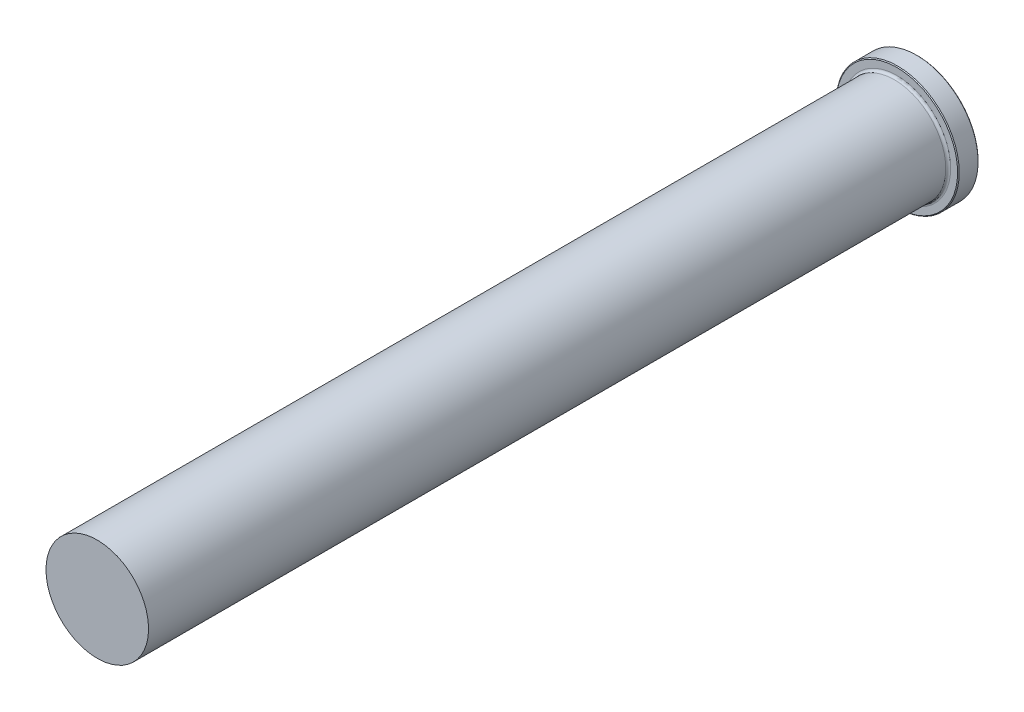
ISO-10303-21;
HEADER;
FILE_DESCRIPTION(('STEP AP214'),'2;1');
FILE_NAME('part.step','',(''),(''),'','','');
FILE_SCHEMA(('AUTOMOTIVE_DESIGN { 1 0 10303 214 1 1 1 1 }'));
ENDSEC;
DATA;
#1=APPLICATION_CONTEXT('core data for automotive mechanical design processes');
#2=APPLICATION_PROTOCOL_DEFINITION('international standard','automotive_design',2000,#1);
#3=PRODUCT_CONTEXT('',#1,'mechanical');
#4=PRODUCT('Part','Part','',(#3));
#5=PRODUCT_RELATED_PRODUCT_CATEGORY('part','',(#4));
#6=PRODUCT_DEFINITION_FORMATION('','',#4);
#7=PRODUCT_DEFINITION_CONTEXT('part definition',#1,'design');
#8=PRODUCT_DEFINITION('design','',#6,#7);
#9=PRODUCT_DEFINITION_SHAPE('','',#8);
#10=(LENGTH_UNIT() NAMED_UNIT(*) SI_UNIT(.MILLI.,.METRE.));
#11=(NAMED_UNIT(*) PLANE_ANGLE_UNIT() SI_UNIT($,.RADIAN.));
#12=(NAMED_UNIT(*) SI_UNIT($,.STERADIAN.) SOLID_ANGLE_UNIT());
#13=UNCERTAINTY_MEASURE_WITH_UNIT(LENGTH_MEASURE(1.E-05),#10,'distance_accuracy_value','');
#14=(GEOMETRIC_REPRESENTATION_CONTEXT(3) GLOBAL_UNCERTAINTY_ASSIGNED_CONTEXT((#13)) GLOBAL_UNIT_ASSIGNED_CONTEXT((#10,
#11,#12)) REPRESENTATION_CONTEXT('',''));
#15=CARTESIAN_POINT('',(0.,0.,0.));
#16=DIRECTION('',(0.,0.,1.));
#17=DIRECTION('',(1.,0.,0.));
#18=AXIS2_PLACEMENT_3D('',#15,#16,#17);
#19=CARTESIAN_POINT('',(0.,0.,0.));
#20=DIRECTION('',(0.,0.,-1.));
#21=DIRECTION('',(-1.,0.,0.));
#22=AXIS2_PLACEMENT_3D('',#19,#20,#21);
#23=PLANE('',#22);
#24=CARTESIAN_POINT('',(0.,0.,0.));
#25=DIRECTION('',(0.,0.,-1.));
#26=DIRECTION('',(-1.,0.,0.));
#27=AXIS2_PLACEMENT_3D('',#24,#25,#26);
#28=CIRCLE('',#27,18.796);
#29=CARTESIAN_POINT('',(-18.796,0.,0.));
#30=VERTEX_POINT('',#29);
#31=EDGE_CURVE('E50',#30,#30,#28,.T.);
#32=ORIENTED_EDGE('',*,*,#31,.T.);
#33=EDGE_LOOP('',(#32));
#34=FACE_BOUND('',#33,.T.);
#35=ADVANCED_FACE('F35',(#34),#23,.T.);
#36=CARTESIAN_POINT('',(0.,0.,0.));
#37=DIRECTION('',(0.,0.,-1.));
#38=DIRECTION('',(-1.,0.,0.));
#39=AXIS2_PLACEMENT_3D('',#36,#37,#38);
#40=CYLINDRICAL_SURFACE('',#39,19.05);
#41=CARTESIAN_POINT('',(0.,0.,0.253999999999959));
#42=DIRECTION('',(0.,0.,-1.));
#43=DIRECTION('',(-1.,0.,0.));
#44=AXIS2_PLACEMENT_3D('',#41,#42,#43);
#45=CIRCLE('',#44,19.05);
#46=CARTESIAN_POINT('',(-19.05,0.,0.253999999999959));
#47=VERTEX_POINT('',#46);
#48=EDGE_CURVE('E42',#47,#47,#45,.F.);
#49=ORIENTED_EDGE('',*,*,#48,.T.);
#50=EDGE_LOOP('',(#49));
#51=FACE_BOUND('',#50,.T.);
#52=CARTESIAN_POINT('',(0.,0.,6.09599999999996));
#53=DIRECTION('',(0.,0.,1.));
#54=DIRECTION('',(1.,0.,0.));
#55=AXIS2_PLACEMENT_3D('',#52,#53,#54);
#56=CIRCLE('',#55,19.05);
#57=CARTESIAN_POINT('',(19.05,0.,6.09599999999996));
#58=VERTEX_POINT('',#57);
#59=EDGE_CURVE('E46',#58,#58,#56,.F.);
#60=ORIENTED_EDGE('',*,*,#59,.T.);
#61=EDGE_LOOP('',(#60));
#62=FACE_BOUND('',#61,.T.);
#63=ADVANCED_FACE('F82',(#51,#62),#40,.T.);
#64=CARTESIAN_POINT('',(0.,19.05,6.35));
#65=DIRECTION('',(0.,0.,1.));
#66=DIRECTION('',(1.,0.,0.));
#67=AXIS2_PLACEMENT_3D('',#64,#65,#66);
#68=PLANE('',#67);
#69=CARTESIAN_POINT('',(0.,0.,6.35));
#70=DIRECTION('',(0.,0.,1.));
#71=DIRECTION('',(1.,0.,0.));
#72=AXIS2_PLACEMENT_3D('',#69,#70,#71);
#73=CIRCLE('',#72,18.796);
#74=CARTESIAN_POINT('',(18.796,0.,6.35));
#75=VERTEX_POINT('',#74);
#76=EDGE_CURVE('E10',#75,#75,#73,.T.);
#77=ORIENTED_EDGE('',*,*,#76,.T.);
#78=EDGE_LOOP('',(#77));
#79=FACE_BOUND('',#78,.T.);
#80=CARTESIAN_POINT('',(0.,0.,6.35));
#81=DIRECTION('',(0.,0.,1.));
#82=DIRECTION('',(1.,0.,0.));
#83=AXIS2_PLACEMENT_3D('',#80,#81,#82);
#84=CIRCLE('',#83,16.637);
#85=CARTESIAN_POINT('',(16.637,0.,6.35));
#86=VERTEX_POINT('',#85);
#87=EDGE_CURVE('E58',#86,#86,#84,.F.);
#88=ORIENTED_EDGE('',*,*,#87,.T.);
#89=EDGE_LOOP('',(#88));
#90=FACE_BOUND('',#89,.T.);
#91=ADVANCED_FACE('F78',(#79,#90),#68,.T.);
#92=CARTESIAN_POINT('',(0.,0.,0.));
#93=DIRECTION('',(0.,0.,-1.));
#94=DIRECTION('',(-1.,0.,0.));
#95=AXIS2_PLACEMENT_3D('',#92,#93,#94);
#96=CYLINDRICAL_SURFACE('',#95,15.875);
#97=CARTESIAN_POINT('',(0.,0.,7.112));
#98=DIRECTION('',(0.,0.,1.));
#99=DIRECTION('',(1.,0.,0.));
#100=AXIS2_PLACEMENT_3D('',#97,#98,#99);
#101=CIRCLE('',#100,15.875);
#102=CARTESIAN_POINT('',(15.875,0.,7.112));
#103=VERTEX_POINT('',#102);
#104=EDGE_CURVE('E55',#103,#103,#101,.T.);
#105=ORIENTED_EDGE('',*,*,#104,.T.);
#106=EDGE_LOOP('',(#105));
#107=FACE_BOUND('',#106,.T.);
#108=CARTESIAN_POINT('',(0.,0.,254.));
#109=DIRECTION('',(0.,0.,-1.));
#110=DIRECTION('',(-1.,0.,0.));
#111=AXIS2_PLACEMENT_3D('',#108,#109,#110);
#112=CIRCLE('',#111,15.875);
#113=CARTESIAN_POINT('',(-15.875,0.,254.));
#114=VERTEX_POINT('',#113);
#115=EDGE_CURVE('E61',#114,#114,#112,.T.);
#116=ORIENTED_EDGE('',*,*,#115,.T.);
#117=EDGE_LOOP('',(#116));
#118=FACE_BOUND('',#117,.T.);
#119=ADVANCED_FACE('F65',(#107,#118),#96,.T.);
#120=CARTESIAN_POINT('',(0.,15.875,254.));
#121=DIRECTION('',(0.,0.,1.));
#122=DIRECTION('',(1.,0.,0.));
#123=AXIS2_PLACEMENT_3D('',#120,#121,#122);
#124=PLANE('',#123);
#125=ORIENTED_EDGE('',*,*,#115,.F.);
#126=EDGE_LOOP('',(#125));
#127=FACE_BOUND('',#126,.T.);
#128=ADVANCED_FACE('F67',(#127),#124,.T.);
#129=CARTESIAN_POINT('',(0.,0.,7.112));
#130=DIRECTION('',(0.,0.,1.));
#131=DIRECTION('',(1.,0.,0.));
#132=AXIS2_PLACEMENT_3D('',#129,#130,#131);
#133=TOROIDAL_SURFACE('',#132,16.637,0.762);
#134=ORIENTED_EDGE('',*,*,#104,.F.);
#135=EDGE_LOOP('',(#134));
#136=FACE_BOUND('',#135,.T.);
#137=ORIENTED_EDGE('',*,*,#87,.F.);
#138=EDGE_LOOP('',(#137));
#139=FACE_BOUND('',#138,.T.);
#140=ADVANCED_FACE('F69',(#136,#139),#133,.F.);
#141=CARTESIAN_POINT('',(0.,0.,0.));
#142=DIRECTION('',(0.,0.,1.));
#143=DIRECTION('',(1.,0.,0.));
#144=AXIS2_PLACEMENT_3D('',#141,#142,#143);
#145=CONICAL_SURFACE('',#144,18.796,0.785398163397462);
#146=ORIENTED_EDGE('',*,*,#48,.F.);
#147=EDGE_LOOP('',(#146));
#148=FACE_BOUND('',#147,.T.);
#149=ORIENTED_EDGE('',*,*,#31,.F.);
#150=EDGE_LOOP('',(#149));
#151=FACE_BOUND('',#150,.T.);
#152=ADVANCED_FACE('F75',(#148,#151),#145,.T.);
#153=CARTESIAN_POINT('',(0.,0.,6.09599999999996));
#154=DIRECTION('',(0.,0.,-1.));
#155=DIRECTION('',(-1.,0.,0.));
#156=AXIS2_PLACEMENT_3D('',#153,#154,#155);
#157=CONICAL_SURFACE('',#156,19.05,0.785398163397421);
#158=ORIENTED_EDGE('',*,*,#76,.F.);
#159=EDGE_LOOP('',(#158));
#160=FACE_BOUND('',#159,.T.);
#161=ORIENTED_EDGE('',*,*,#59,.F.);
#162=EDGE_LOOP('',(#161));
#163=FACE_BOUND('',#162,.T.);
#164=ADVANCED_FACE('F37',(#160,#163),#157,.T.);
#165=CLOSED_SHELL('',(#35,#63,#91,#119,#128,#140,#152,#164));
#166=MANIFOLD_SOLID_BREP('B2',#165);
#167=ADVANCED_BREP_SHAPE_REPRESENTATION('',(#18,#166),#14);
#168=SHAPE_DEFINITION_REPRESENTATION(#9,#167);
ENDSEC;
END-ISO-10303-21;
